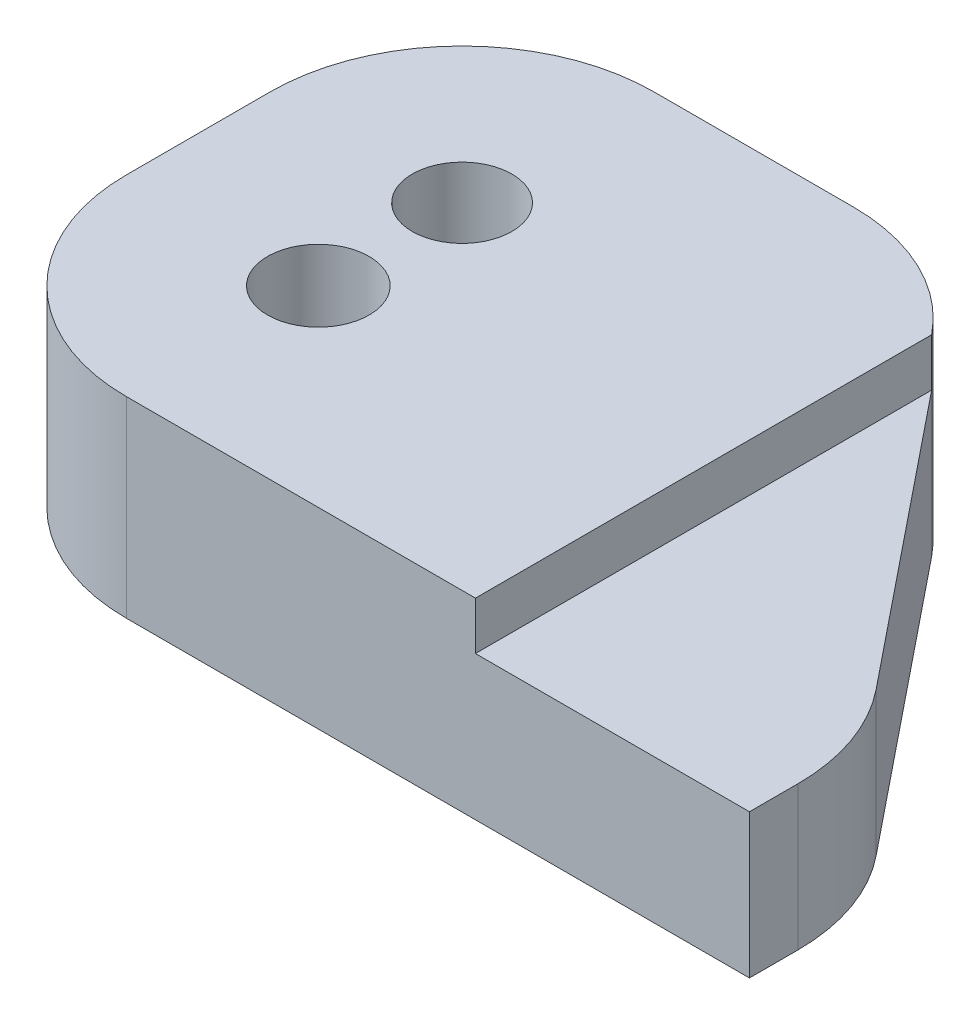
from build123d import *

# Parameters (mm, degrees)
BOSS_EXTRUDE1_DEPTH = 19.05
FILLET1_R           = 25.4
BOSS_EXTRUDE2_START = 6.35
BOSS_EXTRUDE2_DEPTH = 6.35
SKETCH4_R           = 6.721788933
SKETCH4_R_2         = 6.590945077
CUT_EXTRUDE3_DEPTH  = 70.07126712


with BuildPart() as part:
    # Sketch1 → Boss-Extrude1 (new body)
    with BuildSketch(Plane(origin=(0, 0, 0), x_dir=(1, 0, 0), z_dir=(0, 1, 0))):
        Polygon((10.04026689, 34.907603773), (53.917892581, -19.499033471), (53.917892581, -34.907603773), (-53.917892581, -34.907603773), (-53.917892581, 34.907603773), align=None)
    extrude(amount=BOSS_EXTRUDE1_DEPTH)

    # Fillet1
    fillet1_edges = [part.edges().sort_by_distance(p)[0] for p in [
        (-53.917892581, 9.525, -34.907603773),
        (10.04026689, 9.525, -34.907603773),
        (53.917892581, 9.525, 19.499033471),
        (-53.917892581, 9.525, 34.907603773),
    ]]
    fillet(fillet1_edges, radius=FILLET1_R)

    # Sketch3 → Boss-Extrude2 (add)
    with BuildSketch(Plane(origin=(0, 19.05, 0), x_dir=(1, 0, 0), z_dir=(0, 1, 0)).offset(BOSS_EXTRUDE2_START)):
        with BuildLine():
            Line((17.665332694, 25.452803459), (17.665332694, -34.907603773))
            Line((17.665332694, -34.907603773), (-28.517892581, -34.907603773))
            ThreePointArc((-28.517892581, -34.907603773), (-46.478404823, -27.468116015), (-53.917892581, -9.507603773))
            Line((-53.917892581, -9.507603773), (-53.917892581, 9.507603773))
            ThreePointArc((-53.917892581, 9.507603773), (-46.478404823, 27.468116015), (-28.517892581, 34.907603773))
            Line((-28.517892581, 34.907603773), (-2.106126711, 34.907603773))
            ThreePointArc((-2.106126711, 34.907603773), (8.851791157, 32.422315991), (17.665332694, 25.452803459))
        make_face()
    extrude(amount=-BOSS_EXTRUDE2_DEPTH)

    # Sketch4 → Cut-Extrude3 (cut, through all)
    with BuildSketch(Plane(origin=(0, 25.4, 0), x_dir=(1, 0, 0), z_dir=(0, 1, 0))):
        with Locations(Location((-28.517892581, -9.507603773, 0), (0, 0, 270))):
            Circle(SKETCH4_R)
        with Locations(Location((-28.517892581, 9.507603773, 0), (0, 0, 270))):
            Circle(SKETCH4_R_2)
    extrude(amount=-CUT_EXTRUDE3_DEPTH, mode=Mode.SUBTRACT)


solid = part.part
